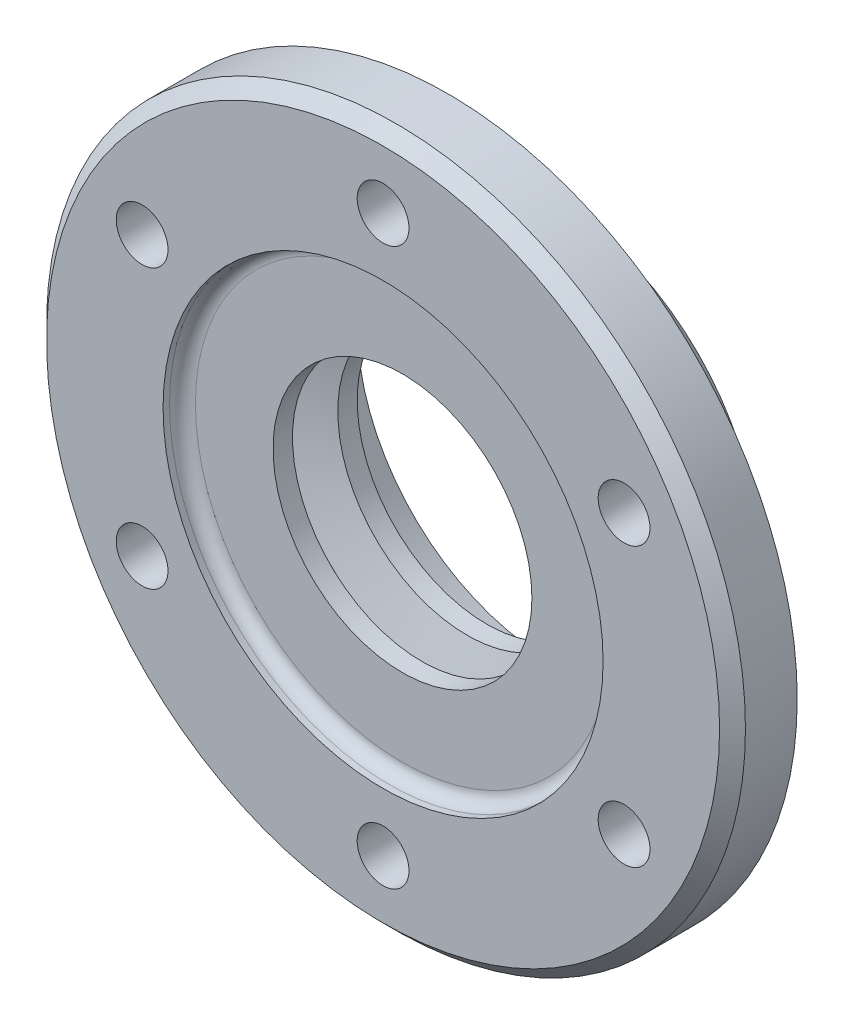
ISO-10303-21;
HEADER;
FILE_DESCRIPTION(('STEP AP214'),'2;1');
FILE_NAME('part.step','',(''),(''),'','','');
FILE_SCHEMA(('AUTOMOTIVE_DESIGN { 1 0 10303 214 1 1 1 1 }'));
ENDSEC;
DATA;
#1=APPLICATION_CONTEXT('core data for automotive mechanical design processes');
#2=APPLICATION_PROTOCOL_DEFINITION('international standard','automotive_design',2000,#1);
#3=PRODUCT_CONTEXT('',#1,'mechanical');
#4=PRODUCT('Part','Part','',(#3));
#5=PRODUCT_RELATED_PRODUCT_CATEGORY('part','',(#4));
#6=PRODUCT_DEFINITION_FORMATION('','',#4);
#7=PRODUCT_DEFINITION_CONTEXT('part definition',#1,'design');
#8=PRODUCT_DEFINITION('design','',#6,#7);
#9=PRODUCT_DEFINITION_SHAPE('','',#8);
#10=(LENGTH_UNIT() NAMED_UNIT(*) SI_UNIT(.MILLI.,.METRE.));
#11=(NAMED_UNIT(*) PLANE_ANGLE_UNIT() SI_UNIT($,.RADIAN.));
#12=(NAMED_UNIT(*) SI_UNIT($,.STERADIAN.) SOLID_ANGLE_UNIT());
#13=UNCERTAINTY_MEASURE_WITH_UNIT(LENGTH_MEASURE(1.E-05),#10,'distance_accuracy_value','');
#14=(GEOMETRIC_REPRESENTATION_CONTEXT(3) GLOBAL_UNCERTAINTY_ASSIGNED_CONTEXT((#13)) GLOBAL_UNIT_ASSIGNED_CONTEXT((#10,
#11,#12)) REPRESENTATION_CONTEXT('',''));
#15=CARTESIAN_POINT('',(0.,0.,0.));
#16=DIRECTION('',(0.,0.,1.));
#17=DIRECTION('',(1.,0.,0.));
#18=AXIS2_PLACEMENT_3D('',#15,#16,#17);
#19=CARTESIAN_POINT('',(0.,0.,5.));
#20=DIRECTION('',(0.,0.,1.));
#21=DIRECTION('',(1.,0.,0.));
#22=AXIS2_PLACEMENT_3D('',#19,#20,#21);
#23=PLANE('',#22);
#24=CARTESIAN_POINT('',(18.6195461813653,-10.7500000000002,5.));
#25=DIRECTION('',(0.,0.,1.));
#26=DIRECTION('',(1.,0.,0.));
#27=AXIS2_PLACEMENT_3D('',#24,#25,#26);
#28=CIRCLE('',#27,2.);
#29=CARTESIAN_POINT('',(20.6195461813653,-10.7500000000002,5.));
#30=VERTEX_POINT('',#29);
#31=EDGE_CURVE('E73',#30,#30,#28,.T.);
#32=ORIENTED_EDGE('',*,*,#31,.F.);
#33=EDGE_LOOP('',(#32));
#34=FACE_BOUND('',#33,.T.);
#35=CARTESIAN_POINT('',(18.6195461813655,10.7499999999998,5.));
#36=DIRECTION('',(0.,0.,1.));
#37=DIRECTION('',(1.,0.,0.));
#38=AXIS2_PLACEMENT_3D('',#35,#36,#37);
#39=CIRCLE('',#38,2.);
#40=CARTESIAN_POINT('',(20.6195461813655,10.7499999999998,5.));
#41=VERTEX_POINT('',#40);
#42=EDGE_CURVE('E63',#41,#41,#39,.T.);
#43=ORIENTED_EDGE('',*,*,#42,.F.);
#44=EDGE_LOOP('',(#43));
#45=FACE_BOUND('',#44,.T.);
#46=CARTESIAN_POINT('',(1.50133784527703E-13,21.5,5.));
#47=DIRECTION('',(0.,0.,1.));
#48=DIRECTION('',(1.,0.,0.));
#49=AXIS2_PLACEMENT_3D('',#46,#47,#48);
#50=CIRCLE('',#49,2.);
#51=CARTESIAN_POINT('',(2.00000000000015,21.5,5.));
#52=VERTEX_POINT('',#51);
#53=EDGE_CURVE('E60',#52,#52,#50,.T.);
#54=ORIENTED_EDGE('',*,*,#53,.F.);
#55=EDGE_LOOP('',(#54));
#56=FACE_BOUND('',#55,.T.);
#57=CARTESIAN_POINT('',(-18.6195461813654,10.7500000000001,5.));
#58=DIRECTION('',(0.,0.,1.));
#59=DIRECTION('',(1.,0.,0.));
#60=AXIS2_PLACEMENT_3D('',#57,#58,#59);
#61=CIRCLE('',#60,2.);
#62=CARTESIAN_POINT('',(-16.6195461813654,10.7500000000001,5.));
#63=VERTEX_POINT('',#62);
#64=EDGE_CURVE('E57',#63,#63,#61,.T.);
#65=ORIENTED_EDGE('',*,*,#64,.F.);
#66=EDGE_LOOP('',(#65));
#67=FACE_BOUND('',#66,.T.);
#68=CARTESIAN_POINT('',(-18.6195461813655,-10.75,5.));
#69=DIRECTION('',(0.,0.,1.));
#70=DIRECTION('',(1.,0.,0.));
#71=AXIS2_PLACEMENT_3D('',#68,#69,#70);
#72=CIRCLE('',#71,2.);
#73=CARTESIAN_POINT('',(-16.6195461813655,-10.75,5.));
#74=VERTEX_POINT('',#73);
#75=EDGE_CURVE('E53',#74,#74,#72,.T.);
#76=ORIENTED_EDGE('',*,*,#75,.F.);
#77=EDGE_LOOP('',(#76));
#78=FACE_BOUND('',#77,.T.);
#79=CARTESIAN_POINT('',(0.,-21.5,5.));
#80=DIRECTION('',(0.,0.,1.));
#81=DIRECTION('',(1.,0.,0.));
#82=AXIS2_PLACEMENT_3D('',#79,#80,#81);
#83=CIRCLE('',#82,2.);
#84=CARTESIAN_POINT('',(2.,-21.5,5.));
#85=VERTEX_POINT('',#84);
#86=EDGE_CURVE('E49',#85,#85,#83,.T.);
#87=ORIENTED_EDGE('',*,*,#86,.F.);
#88=EDGE_LOOP('',(#87));
#89=FACE_BOUND('',#88,.T.);
#90=CARTESIAN_POINT('',(0.,0.,5.));
#91=DIRECTION('',(0.,0.,1.));
#92=DIRECTION('',(1.,0.,0.));
#93=AXIS2_PLACEMENT_3D('',#90,#91,#92);
#94=CIRCLE('',#93,26.);
#95=CARTESIAN_POINT('',(26.,0.,5.));
#96=VERTEX_POINT('',#95);
#97=EDGE_CURVE('E123',#96,#96,#94,.T.);
#98=ORIENTED_EDGE('',*,*,#97,.T.);
#99=EDGE_LOOP('',(#98));
#100=FACE_BOUND('',#99,.T.);
#101=CARTESIAN_POINT('',(0.,0.,5.));
#102=DIRECTION('',(0.,0.,1.));
#103=DIRECTION('',(1.,0.,0.));
#104=AXIS2_PLACEMENT_3D('',#101,#102,#103);
#105=CIRCLE('',#104,17.);
#106=CARTESIAN_POINT('',(17.,0.,5.));
#107=VERTEX_POINT('',#106);
#108=EDGE_CURVE('E48',#107,#107,#105,.T.);
#109=ORIENTED_EDGE('',*,*,#108,.F.);
#110=EDGE_LOOP('',(#109));
#111=FACE_BOUND('',#110,.T.);
#112=ADVANCED_FACE('F28',(#34,#45,#56,#67,#78,#89,#100,#111),#23,.T.);
#113=CARTESIAN_POINT('',(0.,0.,-8.));
#114=DIRECTION('',(0.,0.,-1.));
#115=DIRECTION('',(-1.,0.,0.));
#116=AXIS2_PLACEMENT_3D('',#113,#114,#115);
#117=PLANE('',#116);
#118=CARTESIAN_POINT('',(0.,0.,-8.));
#119=DIRECTION('',(0.,0.,-1.));
#120=DIRECTION('',(-1.,0.,0.));
#121=AXIS2_PLACEMENT_3D('',#118,#119,#120);
#122=CIRCLE('',#121,16.);
#123=CARTESIAN_POINT('',(-16.,0.,-8.));
#124=VERTEX_POINT('',#123);
#125=EDGE_CURVE('E117',#124,#124,#122,.T.);
#126=ORIENTED_EDGE('',*,*,#125,.T.);
#127=EDGE_LOOP('',(#126));
#128=FACE_BOUND('',#127,.T.);
#129=CARTESIAN_POINT('',(0.,0.,-8.));
#130=DIRECTION('',(0.,0.,1.));
#131=DIRECTION('',(1.,0.,0.));
#132=AXIS2_PLACEMENT_3D('',#129,#130,#131);
#133=CIRCLE('',#132,15.);
#134=CARTESIAN_POINT('',(15.,0.,-8.));
#135=VERTEX_POINT('',#134);
#136=EDGE_CURVE('E102',#135,#135,#133,.T.);
#137=ORIENTED_EDGE('',*,*,#136,.T.);
#138=EDGE_LOOP('',(#137));
#139=FACE_BOUND('',#138,.T.);
#140=ADVANCED_FACE('F150',(#128,#139),#117,.T.);
#141=CARTESIAN_POINT('',(0.,0.,0.));
#142=DIRECTION('',(0.,0.,1.));
#143=DIRECTION('',(1.,0.,0.));
#144=AXIS2_PLACEMENT_3D('',#141,#142,#143);
#145=PLANE('',#144);
#146=CARTESIAN_POINT('',(18.6195461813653,-10.7500000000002,0.));
#147=DIRECTION('',(0.,0.,1.));
#148=DIRECTION('',(1.,0.,0.));
#149=AXIS2_PLACEMENT_3D('',#146,#147,#148);
#150=CIRCLE('',#149,2.);
#151=CARTESIAN_POINT('',(20.6195461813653,-10.7500000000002,0.));
#152=VERTEX_POINT('',#151);
#153=EDGE_CURVE('E32',#152,#152,#150,.T.);
#154=ORIENTED_EDGE('',*,*,#153,.T.);
#155=EDGE_LOOP('',(#154));
#156=FACE_BOUND('',#155,.T.);
#157=CARTESIAN_POINT('',(18.6195461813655,10.7499999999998,0.));
#158=DIRECTION('',(0.,0.,1.));
#159=DIRECTION('',(1.,0.,0.));
#160=AXIS2_PLACEMENT_3D('',#157,#158,#159);
#161=CIRCLE('',#160,2.);
#162=CARTESIAN_POINT('',(20.6195461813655,10.7499999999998,0.));
#163=VERTEX_POINT('',#162);
#164=EDGE_CURVE('E61',#163,#163,#161,.T.);
#165=ORIENTED_EDGE('',*,*,#164,.T.);
#166=EDGE_LOOP('',(#165));
#167=FACE_BOUND('',#166,.T.);
#168=CARTESIAN_POINT('',(1.50133784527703E-13,21.5,0.));
#169=DIRECTION('',(0.,0.,1.));
#170=DIRECTION('',(1.,0.,0.));
#171=AXIS2_PLACEMENT_3D('',#168,#169,#170);
#172=CIRCLE('',#171,2.);
#173=CARTESIAN_POINT('',(2.00000000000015,21.5,0.));
#174=VERTEX_POINT('',#173);
#175=EDGE_CURVE('E58',#174,#174,#172,.T.);
#176=ORIENTED_EDGE('',*,*,#175,.T.);
#177=EDGE_LOOP('',(#176));
#178=FACE_BOUND('',#177,.T.);
#179=CARTESIAN_POINT('',(-18.6195461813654,10.7500000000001,0.));
#180=DIRECTION('',(0.,0.,1.));
#181=DIRECTION('',(1.,0.,0.));
#182=AXIS2_PLACEMENT_3D('',#179,#180,#181);
#183=CIRCLE('',#182,2.);
#184=CARTESIAN_POINT('',(-16.6195461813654,10.7500000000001,0.));
#185=VERTEX_POINT('',#184);
#186=EDGE_CURVE('E54',#185,#185,#183,.T.);
#187=ORIENTED_EDGE('',*,*,#186,.T.);
#188=EDGE_LOOP('',(#187));
#189=FACE_BOUND('',#188,.T.);
#190=CARTESIAN_POINT('',(-18.6195461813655,-10.75,0.));
#191=DIRECTION('',(0.,0.,1.));
#192=DIRECTION('',(1.,0.,0.));
#193=AXIS2_PLACEMENT_3D('',#190,#191,#192);
#194=CIRCLE('',#193,2.);
#195=CARTESIAN_POINT('',(-16.6195461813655,-10.75,0.));
#196=VERTEX_POINT('',#195);
#197=EDGE_CURVE('E50',#196,#196,#194,.T.);
#198=ORIENTED_EDGE('',*,*,#197,.T.);
#199=EDGE_LOOP('',(#198));
#200=FACE_BOUND('',#199,.T.);
#201=CARTESIAN_POINT('',(0.,-21.5,0.));
#202=DIRECTION('',(0.,0.,1.));
#203=DIRECTION('',(1.,0.,0.));
#204=AXIS2_PLACEMENT_3D('',#201,#202,#203);
#205=CIRCLE('',#204,2.);
#206=CARTESIAN_POINT('',(2.,-21.5,0.));
#207=VERTEX_POINT('',#206);
#208=EDGE_CURVE('E45',#207,#207,#205,.T.);
#209=ORIENTED_EDGE('',*,*,#208,.T.);
#210=EDGE_LOOP('',(#209));
#211=FACE_BOUND('',#210,.T.);
#212=CARTESIAN_POINT('',(0.,0.,0.));
#213=DIRECTION('',(0.,0.,1.));
#214=DIRECTION('',(1.,0.,0.));
#215=AXIS2_PLACEMENT_3D('',#212,#213,#214);
#216=CIRCLE('',#215,27.);
#217=CARTESIAN_POINT('',(27.,0.,0.));
#218=VERTEX_POINT('',#217);
#219=EDGE_CURVE('E111',#218,#218,#216,.T.);
#220=ORIENTED_EDGE('',*,*,#219,.F.);
#221=EDGE_LOOP('',(#220));
#222=FACE_BOUND('',#221,.T.);
#223=CARTESIAN_POINT('',(0.,0.,0.));
#224=DIRECTION('',(0.,0.,1.));
#225=DIRECTION('',(1.,0.,0.));
#226=AXIS2_PLACEMENT_3D('',#223,#224,#225);
#227=CIRCLE('',#226,16.);
#228=CARTESIAN_POINT('',(16.,0.,0.));
#229=VERTEX_POINT('',#228);
#230=EDGE_CURVE('E114',#229,#229,#227,.F.);
#231=ORIENTED_EDGE('',*,*,#230,.F.);
#232=EDGE_LOOP('',(#231));
#233=FACE_BOUND('',#232,.T.);
#234=ADVANCED_FACE('F152',(#156,#167,#178,#189,#200,#211,#222,#233),#145,.F.);
#235=CARTESIAN_POINT('',(0.,0.,5.));
#236=DIRECTION('',(0.,0.,-1.));
#237=DIRECTION('',(-1.,0.,0.));
#238=AXIS2_PLACEMENT_3D('',#235,#236,#237);
#239=CYLINDRICAL_SURFACE('',#238,27.);
#240=CARTESIAN_POINT('',(0.,0.,4.));
#241=DIRECTION('',(0.,0.,1.));
#242=DIRECTION('',(1.,0.,0.));
#243=AXIS2_PLACEMENT_3D('',#240,#241,#242);
#244=CIRCLE('',#243,27.);
#245=CARTESIAN_POINT('',(27.,0.,4.));
#246=VERTEX_POINT('',#245);
#247=EDGE_CURVE('E126',#246,#246,#244,.F.);
#248=ORIENTED_EDGE('',*,*,#247,.T.);
#249=EDGE_LOOP('',(#248));
#250=FACE_BOUND('',#249,.T.);
#251=ORIENTED_EDGE('',*,*,#219,.T.);
#252=EDGE_LOOP('',(#251));
#253=FACE_BOUND('',#252,.T.);
#254=ADVANCED_FACE('F159',(#250,#253),#239,.T.);
#255=CARTESIAN_POINT('',(0.,0.,-2.));
#256=DIRECTION('',(0.,0.,1.));
#257=DIRECTION('',(1.,0.,0.));
#258=AXIS2_PLACEMENT_3D('',#255,#256,#257);
#259=CYLINDRICAL_SURFACE('',#258,16.);
#260=CARTESIAN_POINT('',(0.,0.,-2.));
#261=DIRECTION('',(0.,0.,-1.));
#262=DIRECTION('',(-1.,0.,0.));
#263=AXIS2_PLACEMENT_3D('',#260,#261,#262);
#264=CIRCLE('',#263,16.);
#265=CARTESIAN_POINT('',(-16.,0.,-2.));
#266=VERTEX_POINT('',#265);
#267=EDGE_CURVE('E108',#266,#266,#264,.T.);
#268=ORIENTED_EDGE('',*,*,#267,.F.);
#269=EDGE_LOOP('',(#268));
#270=FACE_BOUND('',#269,.T.);
#271=ORIENTED_EDGE('',*,*,#230,.T.);
#272=EDGE_LOOP('',(#271));
#273=FACE_BOUND('',#272,.T.);
#274=ADVANCED_FACE('F169',(#270,#273),#259,.T.);
#275=CARTESIAN_POINT('',(0.,0.,-2.));
#276=DIRECTION('',(0.,0.,-1.));
#277=DIRECTION('',(-1.,0.,0.));
#278=AXIS2_PLACEMENT_3D('',#275,#276,#277);
#279=PLANE('',#278);
#280=CARTESIAN_POINT('',(0.,0.,-2.));
#281=DIRECTION('',(0.,0.,-1.));
#282=DIRECTION('',(-1.,0.,0.));
#283=AXIS2_PLACEMENT_3D('',#280,#281,#282);
#284=CIRCLE('',#283,17.);
#285=CARTESIAN_POINT('',(-17.,0.,-2.));
#286=VERTEX_POINT('',#285);
#287=EDGE_CURVE('E105',#286,#286,#284,.T.);
#288=ORIENTED_EDGE('',*,*,#287,.F.);
#289=EDGE_LOOP('',(#288));
#290=FACE_BOUND('',#289,.T.);
#291=ORIENTED_EDGE('',*,*,#267,.T.);
#292=EDGE_LOOP('',(#291));
#293=FACE_BOUND('',#292,.T.);
#294=ADVANCED_FACE('F166',(#290,#293),#279,.F.);
#295=CARTESIAN_POINT('',(0.,0.,-8.));
#296=DIRECTION('',(0.,0.,1.));
#297=DIRECTION('',(1.,0.,0.));
#298=AXIS2_PLACEMENT_3D('',#295,#296,#297);
#299=CYLINDRICAL_SURFACE('',#298,17.);
#300=CARTESIAN_POINT('',(0.,0.,-6.99999999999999));
#301=DIRECTION('',(0.,0.,-1.));
#302=DIRECTION('',(-1.,0.,0.));
#303=AXIS2_PLACEMENT_3D('',#300,#301,#302);
#304=CIRCLE('',#303,17.);
#305=CARTESIAN_POINT('',(-17.,0.,-6.99999999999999));
#306=VERTEX_POINT('',#305);
#307=EDGE_CURVE('E120',#306,#306,#304,.F.);
#308=ORIENTED_EDGE('',*,*,#307,.T.);
#309=EDGE_LOOP('',(#308));
#310=FACE_BOUND('',#309,.T.);
#311=ORIENTED_EDGE('',*,*,#287,.T.);
#312=EDGE_LOOP('',(#311));
#313=FACE_BOUND('',#312,.T.);
#314=ADVANCED_FACE('F146',(#310,#313),#299,.T.);
#315=CARTESIAN_POINT('',(0.,0.,-8.));
#316=DIRECTION('',(0.,0.,-1.));
#317=DIRECTION('',(-1.,0.,0.));
#318=AXIS2_PLACEMENT_3D('',#315,#316,#317);
#319=CONICAL_SURFACE('',#318,15.,0.19739555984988);
#320=CARTESIAN_POINT('',(0.,0.,-3.80388386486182));
#321=DIRECTION('',(0.,0.,-1.));
#322=DIRECTION('',(-1.,0.,0.));
#323=AXIS2_PLACEMENT_3D('',#320,#321,#322);
#324=CIRCLE('',#323,14.1607767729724);
#325=CARTESIAN_POINT('',(-14.1607767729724,0.,-3.80388386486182));
#326=VERTEX_POINT('',#325);
#327=EDGE_CURVE('E129',#326,#326,#324,.F.);
#328=ORIENTED_EDGE('',*,*,#327,.T.);
#329=EDGE_LOOP('',(#328));
#330=FACE_BOUND('',#329,.T.);
#331=ORIENTED_EDGE('',*,*,#136,.F.);
#332=EDGE_LOOP('',(#331));
#333=FACE_BOUND('',#332,.T.);
#334=ADVANCED_FACE('F143',(#330,#333),#319,.F.);
#335=CARTESIAN_POINT('',(0.,10.,-3.));
#336=DIRECTION('',(0.,0.,-1.));
#337=DIRECTION('',(-1.,0.,0.));
#338=AXIS2_PLACEMENT_3D('',#335,#336,#337);
#339=PLANE('',#338);
#340=CARTESIAN_POINT('',(0.,0.,-3.));
#341=DIRECTION('',(0.,0.,-1.));
#342=DIRECTION('',(-1.,0.,0.));
#343=AXIS2_PLACEMENT_3D('',#340,#341,#342);
#344=CIRCLE('',#343,13.1801960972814);
#345=CARTESIAN_POINT('',(-13.1801960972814,0.,-3.));
#346=VERTEX_POINT('',#345);
#347=EDGE_CURVE('E41',#346,#346,#344,.T.);
#348=ORIENTED_EDGE('',*,*,#347,.T.);
#349=EDGE_LOOP('',(#348));
#350=FACE_BOUND('',#349,.T.);
#351=CARTESIAN_POINT('',(0.,0.,-3.));
#352=DIRECTION('',(0.,0.,1.));
#353=DIRECTION('',(1.,0.,0.));
#354=AXIS2_PLACEMENT_3D('',#351,#352,#353);
#355=CIRCLE('',#354,10.);
#356=CARTESIAN_POINT('',(10.,0.,-3.));
#357=VERTEX_POINT('',#356);
#358=EDGE_CURVE('E99',#357,#357,#355,.T.);
#359=ORIENTED_EDGE('',*,*,#358,.T.);
#360=EDGE_LOOP('',(#359));
#361=FACE_BOUND('',#360,.T.);
#362=ADVANCED_FACE('F134',(#350,#361),#339,.T.);
#363=CARTESIAN_POINT('',(0.,0.,6.85181857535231));
#364=DIRECTION('',(0.,0.,1.));
#365=DIRECTION('',(1.,0.,0.));
#366=AXIS2_PLACEMENT_3D('',#363,#364,#365);
#367=CYLINDRICAL_SURFACE('',#366,10.);
#368=CARTESIAN_POINT('',(0.,0.,-1.5));
#369=DIRECTION('',(0.,0.,1.));
#370=DIRECTION('',(1.,0.,0.));
#371=AXIS2_PLACEMENT_3D('',#368,#369,#370);
#372=CIRCLE('',#371,10.);
#373=CARTESIAN_POINT('',(10.,0.,-1.5));
#374=VERTEX_POINT('',#373);
#375=EDGE_CURVE('E96',#374,#374,#372,.T.);
#376=ORIENTED_EDGE('',*,*,#375,.T.);
#377=EDGE_LOOP('',(#376));
#378=FACE_BOUND('',#377,.T.);
#379=ORIENTED_EDGE('',*,*,#358,.F.);
#380=EDGE_LOOP('',(#379));
#381=FACE_BOUND('',#380,.T.);
#382=ADVANCED_FACE('F223',(#378,#381),#367,.F.);
#383=CARTESIAN_POINT('',(0.,0.,-1.5));
#384=DIRECTION('',(0.,0.,1.));
#385=DIRECTION('',(1.,0.,0.));
#386=AXIS2_PLACEMENT_3D('',#383,#384,#385);
#387=CONICAL_SURFACE('',#386,10.,1.29453852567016);
#388=CARTESIAN_POINT('',(0.,0.,-0.5));
#389=DIRECTION('',(0.,0.,1.));
#390=DIRECTION('',(1.,0.,0.));
#391=AXIS2_PLACEMENT_3D('',#388,#389,#390);
#392=CIRCLE('',#391,13.5272493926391);
#393=CARTESIAN_POINT('',(13.5272493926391,0.,-0.5));
#394=VERTEX_POINT('',#393);
#395=EDGE_CURVE('E93',#394,#394,#392,.T.);
#396=ORIENTED_EDGE('',*,*,#395,.T.);
#397=EDGE_LOOP('',(#396));
#398=FACE_BOUND('',#397,.T.);
#399=ORIENTED_EDGE('',*,*,#375,.F.);
#400=EDGE_LOOP('',(#399));
#401=FACE_BOUND('',#400,.T.);
#402=ADVANCED_FACE('F219',(#398,#401),#387,.F.);
#403=CARTESIAN_POINT('',(0.,0.,6.85181857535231));
#404=DIRECTION('',(0.,0.,1.));
#405=DIRECTION('',(1.,0.,0.));
#406=AXIS2_PLACEMENT_3D('',#403,#404,#405);
#407=CYLINDRICAL_SURFACE('',#406,13.5272493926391);
#408=CARTESIAN_POINT('',(0.,0.,1.));
#409=DIRECTION('',(0.,0.,1.));
#410=DIRECTION('',(1.,0.,0.));
#411=AXIS2_PLACEMENT_3D('',#408,#409,#410);
#412=CIRCLE('',#411,13.5272493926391);
#413=CARTESIAN_POINT('',(13.5272493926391,0.,1.));
#414=VERTEX_POINT('',#413);
#415=EDGE_CURVE('E90',#414,#414,#412,.T.);
#416=ORIENTED_EDGE('',*,*,#415,.T.);
#417=EDGE_LOOP('',(#416));
#418=FACE_BOUND('',#417,.T.);
#419=ORIENTED_EDGE('',*,*,#395,.F.);
#420=EDGE_LOOP('',(#419));
#421=FACE_BOUND('',#420,.T.);
#422=ADVANCED_FACE('F215',(#418,#421),#407,.F.);
#423=CARTESIAN_POINT('',(0.,0.,1.));
#424=DIRECTION('',(0.,0.,-1.));
#425=DIRECTION('',(-1.,0.,0.));
#426=AXIS2_PLACEMENT_3D('',#423,#424,#425);
#427=CONICAL_SURFACE('',#426,13.5272493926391,1.29453852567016);
#428=CARTESIAN_POINT('',(0.,0.,2.00000000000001));
#429=DIRECTION('',(0.,0.,1.));
#430=DIRECTION('',(1.,0.,0.));
#431=AXIS2_PLACEMENT_3D('',#428,#429,#430);
#432=CIRCLE('',#431,10.);
#433=CARTESIAN_POINT('',(10.,0.,2.00000000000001));
#434=VERTEX_POINT('',#433);
#435=EDGE_CURVE('E87',#434,#434,#432,.T.);
#436=ORIENTED_EDGE('',*,*,#435,.T.);
#437=EDGE_LOOP('',(#436));
#438=FACE_BOUND('',#437,.T.);
#439=ORIENTED_EDGE('',*,*,#415,.F.);
#440=EDGE_LOOP('',(#439));
#441=FACE_BOUND('',#440,.T.);
#442=ADVANCED_FACE('F211',(#438,#441),#427,.F.);
#443=CARTESIAN_POINT('',(0.,0.,6.85181857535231));
#444=DIRECTION('',(0.,0.,1.));
#445=DIRECTION('',(1.,0.,0.));
#446=AXIS2_PLACEMENT_3D('',#443,#444,#445);
#447=CYLINDRICAL_SURFACE('',#446,10.);
#448=CARTESIAN_POINT('',(0.,0.,3.50000000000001));
#449=DIRECTION('',(0.,0.,1.));
#450=DIRECTION('',(1.,0.,0.));
#451=AXIS2_PLACEMENT_3D('',#448,#449,#450);
#452=CIRCLE('',#451,10.);
#453=CARTESIAN_POINT('',(10.,0.,3.50000000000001));
#454=VERTEX_POINT('',#453);
#455=EDGE_CURVE('E84',#454,#454,#452,.T.);
#456=ORIENTED_EDGE('',*,*,#455,.T.);
#457=EDGE_LOOP('',(#456));
#458=FACE_BOUND('',#457,.T.);
#459=ORIENTED_EDGE('',*,*,#435,.F.);
#460=EDGE_LOOP('',(#459));
#461=FACE_BOUND('',#460,.T.);
#462=ADVANCED_FACE('F202',(#458,#461),#447,.F.);
#463=CARTESIAN_POINT('',(0.,17.,3.50000000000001));
#464=DIRECTION('',(0.,0.,1.));
#465=DIRECTION('',(1.,0.,0.));
#466=AXIS2_PLACEMENT_3D('',#463,#464,#465);
#467=PLANE('',#466);
#468=CARTESIAN_POINT('',(0.,0.,3.50000000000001));
#469=DIRECTION('',(0.,0.,1.));
#470=DIRECTION('',(1.,0.,0.));
#471=AXIS2_PLACEMENT_3D('',#468,#469,#470);
#472=CIRCLE('',#471,16.);
#473=CARTESIAN_POINT('',(16.,0.,3.50000000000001));
#474=VERTEX_POINT('',#473);
#475=EDGE_CURVE('E36',#474,#474,#472,.T.);
#476=ORIENTED_EDGE('',*,*,#475,.T.);
#477=EDGE_LOOP('',(#476));
#478=FACE_BOUND('',#477,.T.);
#479=ORIENTED_EDGE('',*,*,#455,.F.);
#480=EDGE_LOOP('',(#479));
#481=FACE_BOUND('',#480,.T.);
#482=ADVANCED_FACE('F197',(#478,#481),#467,.T.);
#483=CARTESIAN_POINT('',(0.,0.,6.85181857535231));
#484=DIRECTION('',(0.,0.,1.));
#485=DIRECTION('',(1.,0.,0.));
#486=AXIS2_PLACEMENT_3D('',#483,#484,#485);
#487=CYLINDRICAL_SURFACE('',#486,17.);
#488=CARTESIAN_POINT('',(0.,0.,4.50000000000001));
#489=DIRECTION('',(0.,0.,1.));
#490=DIRECTION('',(1.,0.,0.));
#491=AXIS2_PLACEMENT_3D('',#488,#489,#490);
#492=CIRCLE('',#491,17.);
#493=CARTESIAN_POINT('',(17.,0.,4.50000000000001));
#494=VERTEX_POINT('',#493);
#495=EDGE_CURVE('E10',#494,#494,#492,.F.);
#496=ORIENTED_EDGE('',*,*,#495,.T.);
#497=EDGE_LOOP('',(#496));
#498=FACE_BOUND('',#497,.T.);
#499=ORIENTED_EDGE('',*,*,#108,.T.);
#500=EDGE_LOOP('',(#499));
#501=FACE_BOUND('',#500,.T.);
#502=ADVANCED_FACE('F183',(#498,#501),#487,.F.);
#503=CARTESIAN_POINT('',(0.,0.,-8.));
#504=DIRECTION('',(0.,0.,1.));
#505=DIRECTION('',(1.,0.,0.));
#506=AXIS2_PLACEMENT_3D('',#503,#504,#505);
#507=CONICAL_SURFACE('',#506,16.,0.785398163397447);
#508=ORIENTED_EDGE('',*,*,#307,.F.);
#509=EDGE_LOOP('',(#508));
#510=FACE_BOUND('',#509,.T.);
#511=ORIENTED_EDGE('',*,*,#125,.F.);
#512=EDGE_LOOP('',(#511));
#513=FACE_BOUND('',#512,.T.);
#514=ADVANCED_FACE('F180',(#510,#513),#507,.T.);
#515=CARTESIAN_POINT('',(0.,0.,5.));
#516=DIRECTION('',(0.,0.,-1.));
#517=DIRECTION('',(-1.,0.,0.));
#518=AXIS2_PLACEMENT_3D('',#515,#516,#517);
#519=CONICAL_SURFACE('',#518,26.,0.785398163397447);
#520=ORIENTED_EDGE('',*,*,#247,.F.);
#521=EDGE_LOOP('',(#520));
#522=FACE_BOUND('',#521,.T.);
#523=ORIENTED_EDGE('',*,*,#97,.F.);
#524=EDGE_LOOP('',(#523));
#525=FACE_BOUND('',#524,.T.);
#526=ADVANCED_FACE('F140',(#522,#525),#519,.T.);
#527=CARTESIAN_POINT('',(0.,0.,-4.));
#528=DIRECTION('',(0.,0.,-1.));
#529=DIRECTION('',(-1.,0.,0.));
#530=AXIS2_PLACEMENT_3D('',#527,#528,#529);
#531=TOROIDAL_SURFACE('',#530,13.1801960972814,1.);
#532=ORIENTED_EDGE('',*,*,#347,.F.);
#533=EDGE_LOOP('',(#532));
#534=FACE_BOUND('',#533,.T.);
#535=ORIENTED_EDGE('',*,*,#327,.F.);
#536=EDGE_LOOP('',(#535));
#537=FACE_BOUND('',#536,.T.);
#538=ADVANCED_FACE('F137',(#534,#537),#531,.F.);
#539=CARTESIAN_POINT('',(0.,0.,4.50000000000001));
#540=DIRECTION('',(0.,0.,1.));
#541=DIRECTION('',(1.,0.,0.));
#542=AXIS2_PLACEMENT_3D('',#539,#540,#541);
#543=TOROIDAL_SURFACE('',#542,16.,1.);
#544=ORIENTED_EDGE('',*,*,#495,.F.);
#545=EDGE_LOOP('',(#544));
#546=FACE_BOUND('',#545,.T.);
#547=ORIENTED_EDGE('',*,*,#475,.F.);
#548=EDGE_LOOP('',(#547));
#549=FACE_BOUND('',#548,.T.);
#550=ADVANCED_FACE('F30',(#546,#549),#543,.F.);
#551=CARTESIAN_POINT('',(0.,-21.5,-8.));
#552=DIRECTION('',(0.,0.,1.));
#553=DIRECTION('',(1.,0.,0.));
#554=AXIS2_PLACEMENT_3D('',#551,#552,#553);
#555=CYLINDRICAL_SURFACE('',#554,2.);
#556=ORIENTED_EDGE('',*,*,#86,.T.);
#557=EDGE_LOOP('',(#556));
#558=FACE_BOUND('',#557,.T.);
#559=ORIENTED_EDGE('',*,*,#208,.F.);
#560=EDGE_LOOP('',(#559));
#561=FACE_BOUND('',#560,.T.);
#562=ADVANCED_FACE('F206',(#558,#561),#555,.F.);
#563=CARTESIAN_POINT('',(-18.6195461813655,-10.75,-8.));
#564=DIRECTION('',(0.,0.,1.));
#565=DIRECTION('',(1.,0.,0.));
#566=AXIS2_PLACEMENT_3D('',#563,#564,#565);
#567=CYLINDRICAL_SURFACE('',#566,2.);
#568=ORIENTED_EDGE('',*,*,#75,.T.);
#569=EDGE_LOOP('',(#568));
#570=FACE_BOUND('',#569,.T.);
#571=ORIENTED_EDGE('',*,*,#197,.F.);
#572=EDGE_LOOP('',(#571));
#573=FACE_BOUND('',#572,.T.);
#574=ADVANCED_FACE('F302',(#570,#573),#567,.F.);
#575=CARTESIAN_POINT('',(-18.6195461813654,10.7500000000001,-8.));
#576=DIRECTION('',(0.,0.,1.));
#577=DIRECTION('',(1.,0.,0.));
#578=AXIS2_PLACEMENT_3D('',#575,#576,#577);
#579=CYLINDRICAL_SURFACE('',#578,2.);
#580=ORIENTED_EDGE('',*,*,#64,.T.);
#581=EDGE_LOOP('',(#580));
#582=FACE_BOUND('',#581,.T.);
#583=ORIENTED_EDGE('',*,*,#186,.F.);
#584=EDGE_LOOP('',(#583));
#585=FACE_BOUND('',#584,.T.);
#586=ADVANCED_FACE('F311',(#582,#585),#579,.F.);
#587=CARTESIAN_POINT('',(1.50133784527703E-13,21.5,-8.));
#588=DIRECTION('',(0.,0.,1.));
#589=DIRECTION('',(1.,0.,0.));
#590=AXIS2_PLACEMENT_3D('',#587,#588,#589);
#591=CYLINDRICAL_SURFACE('',#590,2.);
#592=ORIENTED_EDGE('',*,*,#53,.T.);
#593=EDGE_LOOP('',(#592));
#594=FACE_BOUND('',#593,.T.);
#595=ORIENTED_EDGE('',*,*,#175,.F.);
#596=EDGE_LOOP('',(#595));
#597=FACE_BOUND('',#596,.T.);
#598=ADVANCED_FACE('F320',(#594,#597),#591,.F.);
#599=CARTESIAN_POINT('',(18.6195461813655,10.7499999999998,-8.));
#600=DIRECTION('',(0.,0.,1.));
#601=DIRECTION('',(1.,0.,0.));
#602=AXIS2_PLACEMENT_3D('',#599,#600,#601);
#603=CYLINDRICAL_SURFACE('',#602,2.);
#604=ORIENTED_EDGE('',*,*,#42,.T.);
#605=EDGE_LOOP('',(#604));
#606=FACE_BOUND('',#605,.T.);
#607=ORIENTED_EDGE('',*,*,#164,.F.);
#608=EDGE_LOOP('',(#607));
#609=FACE_BOUND('',#608,.T.);
#610=ADVANCED_FACE('F330',(#606,#609),#603,.F.);
#611=CARTESIAN_POINT('',(18.6195461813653,-10.7500000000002,-8.));
#612=DIRECTION('',(0.,0.,1.));
#613=DIRECTION('',(1.,0.,0.));
#614=AXIS2_PLACEMENT_3D('',#611,#612,#613);
#615=CYLINDRICAL_SURFACE('',#614,2.);
#616=ORIENTED_EDGE('',*,*,#31,.T.);
#617=EDGE_LOOP('',(#616));
#618=FACE_BOUND('',#617,.T.);
#619=ORIENTED_EDGE('',*,*,#153,.F.);
#620=EDGE_LOOP('',(#619));
#621=FACE_BOUND('',#620,.T.);
#622=ADVANCED_FACE('F340',(#618,#621),#615,.F.);
#623=CLOSED_SHELL('',(#112,#140,#234,#254,#274,#294,#314,#334,#362,#382,#402,#422,#442,#462,
#482,#502,#514,#526,#538,#550,#562,#574,#586,#598,#610,#622));
#624=MANIFOLD_SOLID_BREP('B2',#623);
#625=ADVANCED_BREP_SHAPE_REPRESENTATION('',(#18,#624),#14);
#626=SHAPE_DEFINITION_REPRESENTATION(#9,#625);
ENDSEC;
END-ISO-10303-21;
